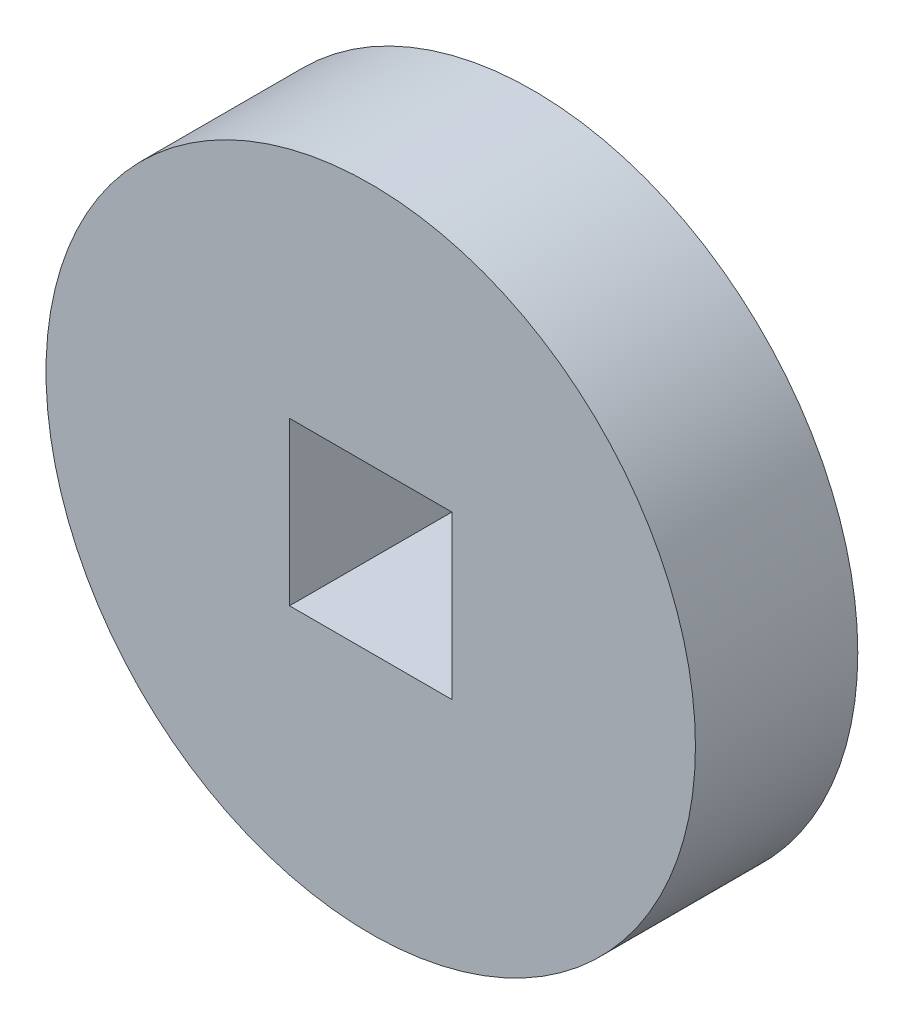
from build123d import *

# Parameters (mm, degrees)
SKETCH1_R           = 12.7
SKETCH1_W           = 6.35
SKETCH1_H           = 6.35
BOSS_EXTRUDE1_DEPTH = 6.35


with BuildPart() as part:
    # Sketch1 → Boss-Extrude1 (new body)
    with BuildSketch(Plane.XY):
        Circle(SKETCH1_R)
        Rectangle(SKETCH1_W, SKETCH1_H, mode=Mode.SUBTRACT)
    extrude(amount=BOSS_EXTRUDE1_DEPTH)


solid = part.part
